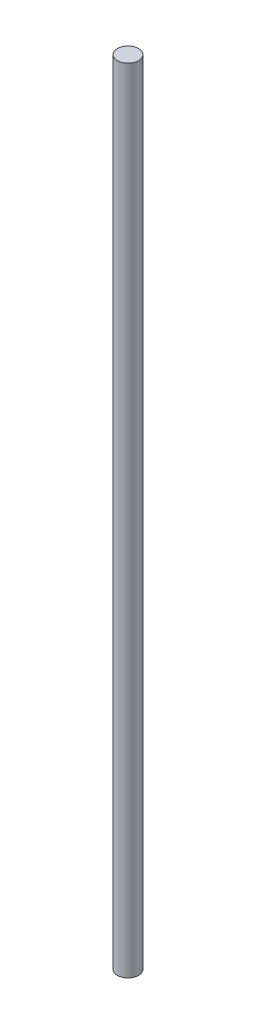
from build123d import *

# Parameters (mm, degrees)
CROQUIS1_W = 4
CROQUIS1_H = 300


with BuildPart() as part:
    # Croquis1 → Revoluci_n1 (revolve)
    with BuildSketch(Plane.XY, mode=Mode.PRIVATE) as revoluci_n1_sk:
        with Locations((2, 150)):
            Rectangle(CROQUIS1_W, CROQUIS1_H)
    revolve(revoluci_n1_sk.sketch.rotate(Axis((0, 0, 0), (0, 1, 0)), 90), axis=Axis((0, 0, 0), (0, 1, 0)))


solid = part.part
